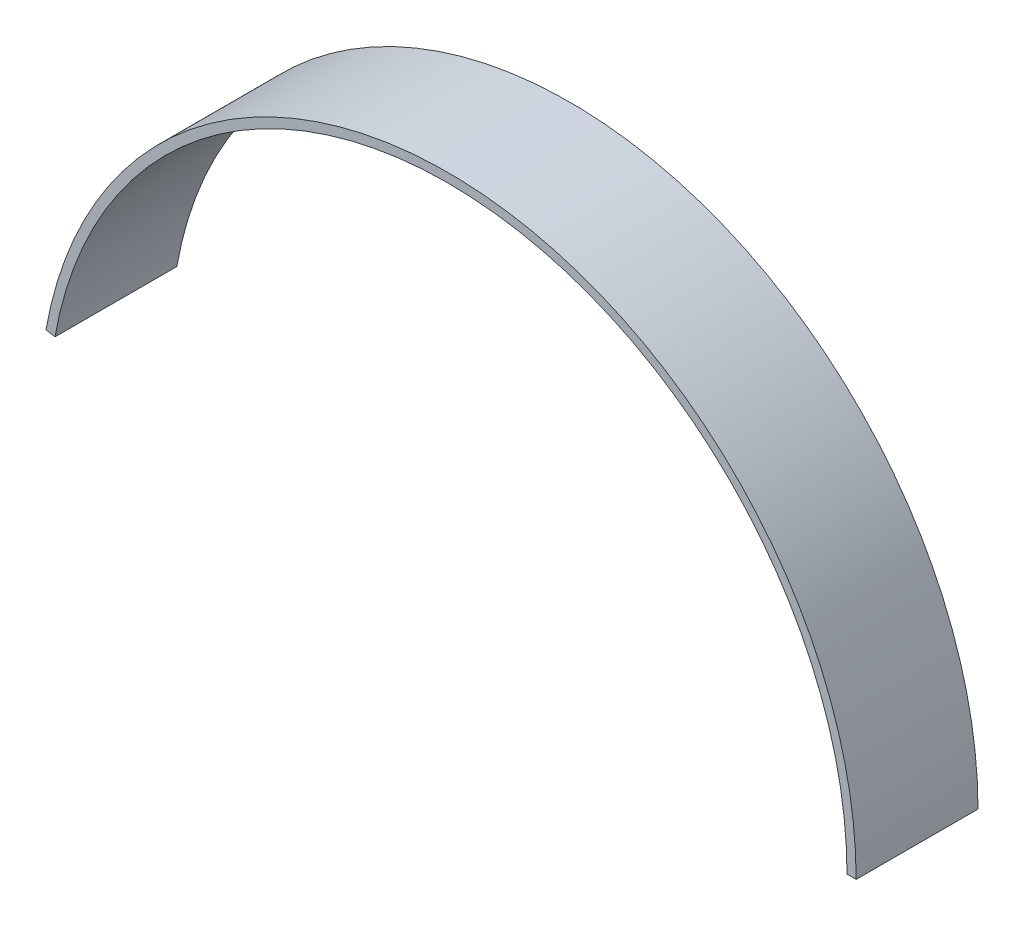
ISO-10303-21;
HEADER;
FILE_DESCRIPTION(('STEP AP214'),'2;1');
FILE_NAME('part.step','',(''),(''),'','','');
FILE_SCHEMA(('AUTOMOTIVE_DESIGN { 1 0 10303 214 1 1 1 1 }'));
ENDSEC;
DATA;
#1=APPLICATION_CONTEXT('core data for automotive mechanical design processes');
#2=APPLICATION_PROTOCOL_DEFINITION('international standard','automotive_design',2000,#1);
#3=PRODUCT_CONTEXT('',#1,'mechanical');
#4=PRODUCT('Part','Part','',(#3));
#5=PRODUCT_RELATED_PRODUCT_CATEGORY('part','',(#4));
#6=PRODUCT_DEFINITION_FORMATION('','',#4);
#7=PRODUCT_DEFINITION_CONTEXT('part definition',#1,'design');
#8=PRODUCT_DEFINITION('design','',#6,#7);
#9=PRODUCT_DEFINITION_SHAPE('','',#8);
#10=(LENGTH_UNIT() NAMED_UNIT(*) SI_UNIT(.MILLI.,.METRE.));
#11=(NAMED_UNIT(*) PLANE_ANGLE_UNIT() SI_UNIT($,.RADIAN.));
#12=(NAMED_UNIT(*) SI_UNIT($,.STERADIAN.) SOLID_ANGLE_UNIT());
#13=UNCERTAINTY_MEASURE_WITH_UNIT(LENGTH_MEASURE(1.E-05),#10,'distance_accuracy_value','');
#14=(GEOMETRIC_REPRESENTATION_CONTEXT(3) GLOBAL_UNCERTAINTY_ASSIGNED_CONTEXT((#13)) GLOBAL_UNIT_ASSIGNED_CONTEXT((#10,
#11,#12)) REPRESENTATION_CONTEXT('',''));
#15=CARTESIAN_POINT('',(0.,0.,0.));
#16=DIRECTION('',(0.,0.,1.));
#17=DIRECTION('',(1.,0.,0.));
#18=AXIS2_PLACEMENT_3D('',#15,#16,#17);
#19=CARTESIAN_POINT('',(7.064694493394,80.749827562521,40.));
#20=DIRECTION('',(0.,0.,1.));
#21=DIRECTION('',(1.,0.,0.));
#22=AXIS2_PLACEMENT_3D('',#19,#20,#21);
#23=PLANE('',#22);
#24=CARTESIAN_POINT('',(0.,0.,40.));
#25=DIRECTION('',(0.,0.,1.));
#26=DIRECTION('',(1.,0.,0.));
#27=AXIS2_PLACEMENT_3D('',#24,#25,#26);
#28=CIRCLE('',#27,134.);
#29=CARTESIAN_POINT('',(134.,0.,40.));
#30=VERTEX_POINT('',#29);
#31=CARTESIAN_POINT('',(-131.9642389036,23.268855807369,40.));
#32=VERTEX_POINT('',#31);
#33=EDGE_CURVE('E81',#30,#32,#28,.T.);
#34=ORIENTED_EDGE('',*,*,#33,.T.);
#35=DIRECTION('',(0.98480775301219,-0.173648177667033,0.));
#36=VECTOR('',#35,1.);
#37=CARTESIAN_POINT('',(-131.9642389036,23.268855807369,40.));
#38=LINE('',#37,#36);
#39=CARTESIAN_POINT('',(-129.0098156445,22.747911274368,40.));
#40=VERTEX_POINT('',#39);
#41=EDGE_CURVE('E103',#32,#40,#38,.T.);
#42=ORIENTED_EDGE('',*,*,#41,.T.);
#43=CARTESIAN_POINT('',(0.,0.,40.));
#44=DIRECTION('',(0.,0.,1.));
#45=DIRECTION('',(1.,0.,0.));
#46=AXIS2_PLACEMENT_3D('',#43,#44,#45);
#47=CIRCLE('',#46,131.);
#48=CARTESIAN_POINT('',(131.,0.,40.));
#49=VERTEX_POINT('',#48);
#50=EDGE_CURVE('E106',#49,#40,#47,.T.);
#51=ORIENTED_EDGE('',*,*,#50,.F.);
#52=DIRECTION('',(1.,0.,0.));
#53=VECTOR('',#52,1.);
#54=CARTESIAN_POINT('',(131.,0.,40.));
#55=LINE('',#54,#53);
#56=EDGE_CURVE('E10',#49,#30,#55,.T.);
#57=ORIENTED_EDGE('',*,*,#56,.T.);
#58=EDGE_LOOP('',(#34,#42,#51,#57));
#59=FACE_BOUND('',#58,.T.);
#60=ADVANCED_FACE('F16',(#59),#23,.T.);
#61=CARTESIAN_POINT('',(7.064694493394,80.749827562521,0.));
#62=DIRECTION('',(0.,0.,1.));
#63=DIRECTION('',(1.,0.,0.));
#64=AXIS2_PLACEMENT_3D('',#61,#62,#63);
#65=PLANE('',#64);
#66=DIRECTION('',(1.,0.,0.));
#67=VECTOR('',#66,1.);
#68=CARTESIAN_POINT('',(131.,0.,0.));
#69=LINE('',#68,#67);
#70=CARTESIAN_POINT('',(131.,0.,0.));
#71=VERTEX_POINT('',#70);
#72=CARTESIAN_POINT('',(134.,0.,0.));
#73=VERTEX_POINT('',#72);
#74=EDGE_CURVE('E19',#71,#73,#69,.T.);
#75=ORIENTED_EDGE('',*,*,#74,.F.);
#76=CARTESIAN_POINT('',(0.,0.,0.));
#77=DIRECTION('',(0.,0.,1.));
#78=DIRECTION('',(1.,0.,0.));
#79=AXIS2_PLACEMENT_3D('',#76,#77,#78);
#80=CIRCLE('',#79,131.);
#81=CARTESIAN_POINT('',(-129.0098156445,22.747911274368,0.));
#82=VERTEX_POINT('',#81);
#83=EDGE_CURVE('E74',#71,#82,#80,.T.);
#84=ORIENTED_EDGE('',*,*,#83,.T.);
#85=DIRECTION('',(0.98480775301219,-0.173648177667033,0.));
#86=VECTOR('',#85,1.);
#87=CARTESIAN_POINT('',(-131.9642389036,23.268855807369,0.));
#88=LINE('',#87,#86);
#89=CARTESIAN_POINT('',(-131.9642389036,23.268855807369,0.));
#90=VERTEX_POINT('',#89);
#91=EDGE_CURVE('E83',#90,#82,#88,.T.);
#92=ORIENTED_EDGE('',*,*,#91,.F.);
#93=CARTESIAN_POINT('',(0.,0.,0.));
#94=DIRECTION('',(0.,0.,1.));
#95=DIRECTION('',(1.,0.,0.));
#96=AXIS2_PLACEMENT_3D('',#93,#94,#95);
#97=CIRCLE('',#96,134.);
#98=EDGE_CURVE('E79',#73,#90,#97,.T.);
#99=ORIENTED_EDGE('',*,*,#98,.F.);
#100=EDGE_LOOP('',(#75,#84,#92,#99));
#101=FACE_BOUND('',#100,.T.);
#102=ADVANCED_FACE('F85',(#101),#65,.F.);
#103=CARTESIAN_POINT('',(131.,0.,0.));
#104=DIRECTION('',(0.,1.,0.));
#105=DIRECTION('',(1.,0.,0.));
#106=AXIS2_PLACEMENT_3D('',#103,#104,#105);
#107=PLANE('',#106);
#108=ORIENTED_EDGE('',*,*,#74,.T.);
#109=DIRECTION('',(0.,0.,1.));
#110=VECTOR('',#109,1.);
#111=CARTESIAN_POINT('',(134.,0.,0.));
#112=LINE('',#111,#110);
#113=EDGE_CURVE('E69',#73,#30,#112,.T.);
#114=ORIENTED_EDGE('',*,*,#113,.T.);
#115=ORIENTED_EDGE('',*,*,#56,.F.);
#116=DIRECTION('',(0.,0.,1.));
#117=VECTOR('',#116,1.);
#118=CARTESIAN_POINT('',(131.,0.,0.));
#119=LINE('',#118,#117);
#120=EDGE_CURVE('E72',#71,#49,#119,.T.);
#121=ORIENTED_EDGE('',*,*,#120,.F.);
#122=EDGE_LOOP('',(#108,#114,#115,#121));
#123=FACE_BOUND('',#122,.T.);
#124=ADVANCED_FACE('F68',(#123),#107,.F.);
#125=CARTESIAN_POINT('',(0.,0.,0.));
#126=DIRECTION('',(0.,0.,-1.));
#127=DIRECTION('',(1.,0.,0.));
#128=AXIS2_PLACEMENT_3D('',#125,#126,#127);
#129=CYLINDRICAL_SURFACE('',#128,131.);
#130=ORIENTED_EDGE('',*,*,#120,.T.);
#131=ORIENTED_EDGE('',*,*,#50,.T.);
#132=DIRECTION('',(0.,0.,1.));
#133=VECTOR('',#132,1.);
#134=CARTESIAN_POINT('',(-129.0098156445,22.747911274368,0.));
#135=LINE('',#134,#133);
#136=EDGE_CURVE('E99',#82,#40,#135,.T.);
#137=ORIENTED_EDGE('',*,*,#136,.F.);
#138=ORIENTED_EDGE('',*,*,#83,.F.);
#139=EDGE_LOOP('',(#130,#131,#137,#138));
#140=FACE_BOUND('',#139,.T.);
#141=ADVANCED_FACE('F115',(#140),#129,.F.);
#142=CARTESIAN_POINT('',(-131.9642389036,23.268855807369,0.));
#143=DIRECTION('',(0.173648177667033,0.98480775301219,0.));
#144=DIRECTION('',(0.,0.,-1.));
#145=AXIS2_PLACEMENT_3D('',#142,#143,#144);
#146=PLANE('',#145);
#147=ORIENTED_EDGE('',*,*,#91,.T.);
#148=ORIENTED_EDGE('',*,*,#136,.T.);
#149=ORIENTED_EDGE('',*,*,#41,.F.);
#150=DIRECTION('',(0.,0.,1.));
#151=VECTOR('',#150,1.);
#152=CARTESIAN_POINT('',(-131.9642389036,23.268855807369,0.));
#153=LINE('',#152,#151);
#154=EDGE_CURVE('E89',#90,#32,#153,.T.);
#155=ORIENTED_EDGE('',*,*,#154,.F.);
#156=EDGE_LOOP('',(#147,#148,#149,#155));
#157=FACE_BOUND('',#156,.T.);
#158=ADVANCED_FACE('F118',(#157),#146,.F.);
#159=CARTESIAN_POINT('',(0.,0.,0.));
#160=DIRECTION('',(0.,0.,-1.));
#161=DIRECTION('',(1.,0.,0.));
#162=AXIS2_PLACEMENT_3D('',#159,#160,#161);
#163=CYLINDRICAL_SURFACE('',#162,134.);
#164=ORIENTED_EDGE('',*,*,#98,.T.);
#165=ORIENTED_EDGE('',*,*,#154,.T.);
#166=ORIENTED_EDGE('',*,*,#33,.F.);
#167=ORIENTED_EDGE('',*,*,#113,.F.);
#168=EDGE_LOOP('',(#164,#165,#166,#167));
#169=FACE_BOUND('',#168,.T.);
#170=ADVANCED_FACE('F77',(#169),#163,.T.);
#171=CLOSED_SHELL('',(#60,#102,#124,#141,#158,#170));
#172=MANIFOLD_SOLID_BREP('B1',#171);
#173=ADVANCED_BREP_SHAPE_REPRESENTATION('',(#18,#172),#14);
#174=SHAPE_DEFINITION_REPRESENTATION(#9,#173);
ENDSEC;
END-ISO-10303-21;
